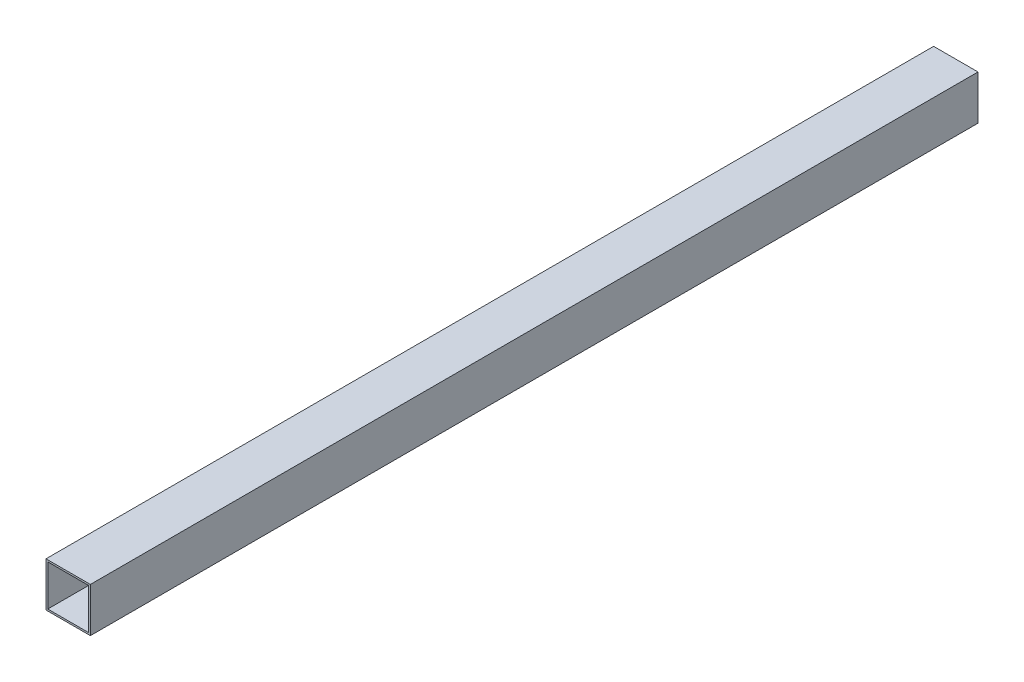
from build123d import *

# Parameters (mm, degrees)
SCHIZZO1_W                = 30
SCHIZZO1_H                = 30
SCHIZZO1_W_2              = 27.6
SCHIZZO1_H_2              = 27.6
ESTRUSIONE_SOTTILE1_DEPTH = 600


with BuildPart() as part:
    # Schizzo1 → Estrusione-Sottile1 (new body)
    with BuildSketch(Plane.XY):
        Rectangle(SCHIZZO1_W, SCHIZZO1_H)
        Rectangle(SCHIZZO1_W_2, SCHIZZO1_H_2, mode=Mode.SUBTRACT)
    extrude(amount=ESTRUSIONE_SOTTILE1_DEPTH)


solid = part.part
